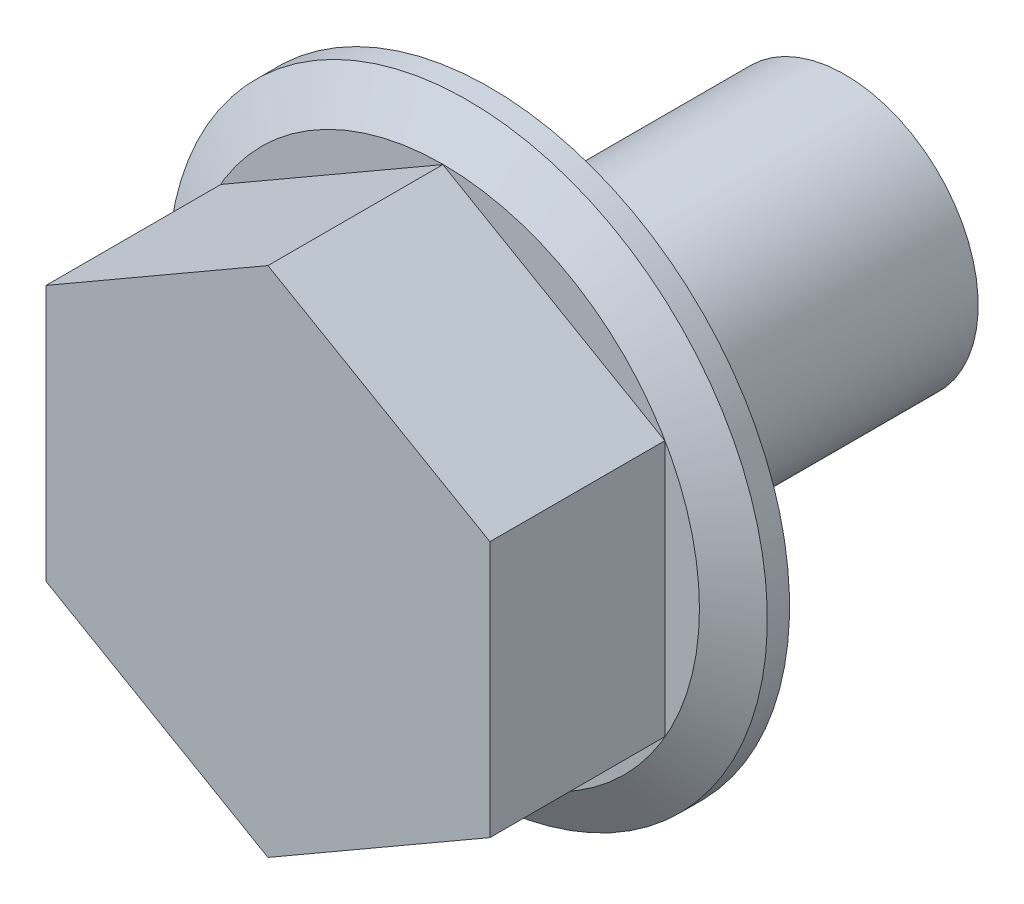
ISO-10303-21;
HEADER;
FILE_DESCRIPTION(('STEP AP214'),'2;1');
FILE_NAME('part.step','',(''),(''),'','','');
FILE_SCHEMA(('AUTOMOTIVE_DESIGN { 1 0 10303 214 1 1 1 1 }'));
ENDSEC;
DATA;
#1=APPLICATION_CONTEXT('core data for automotive mechanical design processes');
#2=APPLICATION_PROTOCOL_DEFINITION('international standard','automotive_design',2000,#1);
#3=PRODUCT_CONTEXT('',#1,'mechanical');
#4=PRODUCT('Part','Part','',(#3));
#5=PRODUCT_RELATED_PRODUCT_CATEGORY('part','',(#4));
#6=PRODUCT_DEFINITION_FORMATION('','',#4);
#7=PRODUCT_DEFINITION_CONTEXT('part definition',#1,'design');
#8=PRODUCT_DEFINITION('design','',#6,#7);
#9=PRODUCT_DEFINITION_SHAPE('','',#8);
#10=(LENGTH_UNIT() NAMED_UNIT(*) SI_UNIT(.MILLI.,.METRE.));
#11=(NAMED_UNIT(*) PLANE_ANGLE_UNIT() SI_UNIT($,.RADIAN.));
#12=(NAMED_UNIT(*) SI_UNIT($,.STERADIAN.) SOLID_ANGLE_UNIT());
#13=UNCERTAINTY_MEASURE_WITH_UNIT(LENGTH_MEASURE(1.E-05),#10,'distance_accuracy_value','');
#14=(GEOMETRIC_REPRESENTATION_CONTEXT(3) GLOBAL_UNCERTAINTY_ASSIGNED_CONTEXT((#13)) GLOBAL_UNIT_ASSIGNED_CONTEXT((#10,
#11,#12)) REPRESENTATION_CONTEXT('',''));
#15=CARTESIAN_POINT('',(0.,0.,0.));
#16=DIRECTION('',(0.,0.,1.));
#17=DIRECTION('',(1.,0.,0.));
#18=AXIS2_PLACEMENT_3D('',#15,#16,#17);
#19=CARTESIAN_POINT('',(0.,0.,0.5));
#20=DIRECTION('',(0.,0.,-1.));
#21=DIRECTION('',(-1.,0.,0.));
#22=AXIS2_PLACEMENT_3D('',#19,#20,#21);
#23=CONICAL_SURFACE('',#22,6.75,1.0471975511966);
#24=CARTESIAN_POINT('',(0.,0.,0.5));
#25=DIRECTION('',(0.,0.,-1.));
#26=DIRECTION('',(-1.,0.,0.));
#27=AXIS2_PLACEMENT_3D('',#24,#25,#26);
#28=CIRCLE('',#27,6.75);
#29=CARTESIAN_POINT('',(-6.75,0.,0.5));
#30=VERTEX_POINT('',#29);
#31=EDGE_CURVE('E123',#30,#30,#28,.T.);
#32=ORIENTED_EDGE('',*,*,#31,.F.);
#33=EDGE_LOOP('',(#32));
#34=FACE_BOUND('',#33,.T.);
#35=CARTESIAN_POINT('',(0.,0.,1.06));
#36=DIRECTION('',(0.,0.,1.));
#37=DIRECTION('',(1.,0.,0.));
#38=AXIS2_PLACEMENT_3D('',#35,#36,#37);
#39=CIRCLE('',#38,5.78005154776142);
#40=CARTESIAN_POINT('',(5.78005154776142,0.,1.06));
#41=VERTEX_POINT('',#40);
#42=EDGE_CURVE('E18',#41,#41,#39,.F.);
#43=ORIENTED_EDGE('',*,*,#42,.T.);
#44=EDGE_LOOP('',(#43));
#45=FACE_BOUND('',#44,.T.);
#46=ADVANCED_FACE('F14',(#34,#45),#23,.T.);
#47=CARTESIAN_POINT('',(0.,0.,-30.));
#48=DIRECTION('',(0.,0.,-1.));
#49=DIRECTION('',(-1.,0.,0.));
#50=AXIS2_PLACEMENT_3D('',#47,#48,#49);
#51=CYLINDRICAL_SURFACE('',#50,3.);
#52=CARTESIAN_POINT('',(0.,0.,0.));
#53=DIRECTION('',(0.,0.,-1.));
#54=DIRECTION('',(-1.,0.,0.));
#55=AXIS2_PLACEMENT_3D('',#52,#53,#54);
#56=CIRCLE('',#55,3.);
#57=CARTESIAN_POINT('',(-3.,0.,0.));
#58=VERTEX_POINT('',#57);
#59=EDGE_CURVE('E9',#58,#58,#56,.T.);
#60=ORIENTED_EDGE('',*,*,#59,.T.);
#61=EDGE_LOOP('',(#60));
#62=FACE_BOUND('',#61,.T.);
#63=CARTESIAN_POINT('',(0.,0.,-8.));
#64=DIRECTION('',(0.,0.,-1.));
#65=DIRECTION('',(-1.,0.,0.));
#66=AXIS2_PLACEMENT_3D('',#63,#64,#65);
#67=CIRCLE('',#66,3.);
#68=CARTESIAN_POINT('',(-3.,0.,-8.));
#69=VERTEX_POINT('',#68);
#70=EDGE_CURVE('E120',#69,#69,#67,.T.);
#71=ORIENTED_EDGE('',*,*,#70,.F.);
#72=EDGE_LOOP('',(#71));
#73=FACE_BOUND('',#72,.T.);
#74=ADVANCED_FACE('F16',(#62,#73),#51,.T.);
#75=CARTESIAN_POINT('',(0.,3.,0.));
#76=DIRECTION('',(0.,0.,-1.));
#77=DIRECTION('',(-1.,0.,0.));
#78=AXIS2_PLACEMENT_3D('',#75,#76,#77);
#79=PLANE('',#78);
#80=CARTESIAN_POINT('',(0.,0.,0.));
#81=DIRECTION('',(0.,0.,-1.));
#82=DIRECTION('',(-1.,0.,0.));
#83=AXIS2_PLACEMENT_3D('',#80,#81,#82);
#84=CIRCLE('',#83,6.75);
#85=CARTESIAN_POINT('',(-6.75,0.,0.));
#86=VERTEX_POINT('',#85);
#87=EDGE_CURVE('E23',#86,#86,#84,.T.);
#88=ORIENTED_EDGE('',*,*,#87,.T.);
#89=EDGE_LOOP('',(#88));
#90=FACE_BOUND('',#89,.T.);
#91=ORIENTED_EDGE('',*,*,#59,.F.);
#92=EDGE_LOOP('',(#91));
#93=FACE_BOUND('',#92,.T.);
#94=ADVANCED_FACE('F129',(#90,#93),#79,.T.);
#95=CARTESIAN_POINT('',(0.,0.,-30.));
#96=DIRECTION('',(0.,0.,-1.));
#97=DIRECTION('',(-1.,0.,0.));
#98=AXIS2_PLACEMENT_3D('',#95,#96,#97);
#99=CYLINDRICAL_SURFACE('',#98,6.75);
#100=ORIENTED_EDGE('',*,*,#31,.T.);
#101=EDGE_LOOP('',(#100));
#102=FACE_BOUND('',#101,.T.);
#103=ORIENTED_EDGE('',*,*,#87,.F.);
#104=EDGE_LOOP('',(#103));
#105=FACE_BOUND('',#104,.T.);
#106=ADVANCED_FACE('F132',(#102,#105),#99,.T.);
#107=CARTESIAN_POINT('',(0.,3.,-8.));
#108=DIRECTION('',(0.,0.,1.));
#109=DIRECTION('',(1.,0.,0.));
#110=AXIS2_PLACEMENT_3D('',#107,#108,#109);
#111=PLANE('',#110);
#112=ORIENTED_EDGE('',*,*,#70,.T.);
#113=EDGE_LOOP('',(#112));
#114=FACE_BOUND('',#113,.T.);
#115=ADVANCED_FACE('F134',(#114),#111,.F.);
#116=CARTESIAN_POINT('',(0.,0.,1.06));
#117=DIRECTION('',(0.,0.,1.));
#118=DIRECTION('',(1.,0.,0.));
#119=AXIS2_PLACEMENT_3D('',#116,#117,#118);
#120=PLANE('',#119);
#121=ORIENTED_EDGE('',*,*,#42,.F.);
#122=EDGE_LOOP('',(#121));
#123=FACE_BOUND('',#122,.T.);
#124=DIRECTION('',(0.,-1.,0.));
#125=VECTOR('',#124,1.);
#126=CARTESIAN_POINT('',(5.,2.88675134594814,1.06));
#127=LINE('',#126,#125);
#128=CARTESIAN_POINT('',(5.,2.88675134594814,1.06));
#129=VERTEX_POINT('',#128);
#130=CARTESIAN_POINT('',(5.,-2.88675134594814,1.06));
#131=VERTEX_POINT('',#130);
#132=EDGE_CURVE('E109',#129,#131,#127,.T.);
#133=ORIENTED_EDGE('',*,*,#132,.T.);
#134=DIRECTION('',(-0.866025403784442,-0.5,0.));
#135=VECTOR('',#134,1.);
#136=CARTESIAN_POINT('',(5.,-2.88675134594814,1.06));
#137=LINE('',#136,#135);
#138=CARTESIAN_POINT('',(0.,-5.77350269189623,1.06));
#139=VERTEX_POINT('',#138);
#140=EDGE_CURVE('E106',#131,#139,#137,.T.);
#141=ORIENTED_EDGE('',*,*,#140,.T.);
#142=DIRECTION('',(0.866025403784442,-0.5,0.));
#143=VECTOR('',#142,1.);
#144=CARTESIAN_POINT('',(-5.,-2.88675134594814,1.06));
#145=LINE('',#144,#143);
#146=CARTESIAN_POINT('',(-5.,-2.88675134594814,1.06));
#147=VERTEX_POINT('',#146);
#148=EDGE_CURVE('E104',#147,#139,#145,.T.);
#149=ORIENTED_EDGE('',*,*,#148,.F.);
#150=DIRECTION('',(0.,-1.,0.));
#151=VECTOR('',#150,1.);
#152=CARTESIAN_POINT('',(-5.,2.88675134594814,1.06));
#153=LINE('',#152,#151);
#154=CARTESIAN_POINT('',(-5.,2.88675134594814,1.06));
#155=VERTEX_POINT('',#154);
#156=EDGE_CURVE('E38',#155,#147,#153,.T.);
#157=ORIENTED_EDGE('',*,*,#156,.F.);
#158=DIRECTION('',(0.866025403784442,0.5,0.));
#159=VECTOR('',#158,1.);
#160=CARTESIAN_POINT('',(-5.,2.88675134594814,1.06));
#161=LINE('',#160,#159);
#162=CARTESIAN_POINT('',(0.,5.77350269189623,1.06));
#163=VERTEX_POINT('',#162);
#164=EDGE_CURVE('E101',#155,#163,#161,.T.);
#165=ORIENTED_EDGE('',*,*,#164,.T.);
#166=DIRECTION('',(-0.866025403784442,0.5,0.));
#167=VECTOR('',#166,1.);
#168=CARTESIAN_POINT('',(5.,2.88675134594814,1.06));
#169=LINE('',#168,#167);
#170=EDGE_CURVE('E98',#129,#163,#169,.T.);
#171=ORIENTED_EDGE('',*,*,#170,.F.);
#172=EDGE_LOOP('',(#133,#141,#149,#157,#165,#171));
#173=FACE_BOUND('',#172,.T.);
#174=ADVANCED_FACE('F143',(#123,#173),#120,.T.);
#175=CARTESIAN_POINT('',(5.,2.88675134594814,1.06));
#176=DIRECTION('',(0.5,0.866025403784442,0.));
#177=DIRECTION('',(-0.866025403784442,0.5,0.));
#178=AXIS2_PLACEMENT_3D('',#175,#176,#177);
#179=PLANE('',#178);
#180=DIRECTION('',(0.,0.,1.));
#181=VECTOR('',#180,1.);
#182=CARTESIAN_POINT('',(5.,2.88675134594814,1.06));
#183=LINE('',#182,#181);
#184=CARTESIAN_POINT('',(5.,2.88675134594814,5.));
#185=VERTEX_POINT('',#184);
#186=EDGE_CURVE('E118',#129,#185,#183,.T.);
#187=ORIENTED_EDGE('',*,*,#186,.F.);
#188=ORIENTED_EDGE('',*,*,#170,.T.);
#189=DIRECTION('',(0.,0.,1.));
#190=VECTOR('',#189,1.);
#191=CARTESIAN_POINT('',(0.,5.77350269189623,1.06));
#192=LINE('',#191,#190);
#193=CARTESIAN_POINT('',(0.,5.77350269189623,5.));
#194=VERTEX_POINT('',#193);
#195=EDGE_CURVE('E112',#163,#194,#192,.T.);
#196=ORIENTED_EDGE('',*,*,#195,.T.);
#197=DIRECTION('',(-0.866025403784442,0.5,0.));
#198=VECTOR('',#197,1.);
#199=CARTESIAN_POINT('',(5.,2.88675134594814,5.));
#200=LINE('',#199,#198);
#201=EDGE_CURVE('E90',#185,#194,#200,.T.);
#202=ORIENTED_EDGE('',*,*,#201,.F.);
#203=EDGE_LOOP('',(#187,#188,#196,#202));
#204=FACE_BOUND('',#203,.T.);
#205=ADVANCED_FACE('F162',(#204),#179,.T.);
#206=CARTESIAN_POINT('',(5.,2.88675134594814,1.06));
#207=DIRECTION('',(-1.,0.,0.));
#208=DIRECTION('',(0.,0.,1.));
#209=AXIS2_PLACEMENT_3D('',#206,#207,#208);
#210=PLANE('',#209);
#211=DIRECTION('',(0.,0.,1.));
#212=VECTOR('',#211,1.);
#213=CARTESIAN_POINT('',(5.,-2.88675134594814,1.06));
#214=LINE('',#213,#212);
#215=CARTESIAN_POINT('',(5.,-2.88675134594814,5.));
#216=VERTEX_POINT('',#215);
#217=EDGE_CURVE('E116',#131,#216,#214,.T.);
#218=ORIENTED_EDGE('',*,*,#217,.F.);
#219=ORIENTED_EDGE('',*,*,#132,.F.);
#220=ORIENTED_EDGE('',*,*,#186,.T.);
#221=DIRECTION('',(0.,-1.,0.));
#222=VECTOR('',#221,1.);
#223=CARTESIAN_POINT('',(5.,2.88675134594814,5.));
#224=LINE('',#223,#222);
#225=EDGE_CURVE('E95',#185,#216,#224,.T.);
#226=ORIENTED_EDGE('',*,*,#225,.T.);
#227=EDGE_LOOP('',(#218,#219,#220,#226));
#228=FACE_BOUND('',#227,.T.);
#229=ADVANCED_FACE('F164',(#228),#210,.F.);
#230=CARTESIAN_POINT('',(5.,-2.88675134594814,1.06));
#231=DIRECTION('',(-0.5,0.866025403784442,0.));
#232=DIRECTION('',(-0.866025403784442,-0.5,0.));
#233=AXIS2_PLACEMENT_3D('',#230,#231,#232);
#234=PLANE('',#233);
#235=DIRECTION('',(0.,0.,1.));
#236=VECTOR('',#235,1.);
#237=CARTESIAN_POINT('',(0.,-5.77350269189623,1.06));
#238=LINE('',#237,#236);
#239=CARTESIAN_POINT('',(0.,-5.77350269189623,5.));
#240=VERTEX_POINT('',#239);
#241=EDGE_CURVE('E72',#139,#240,#238,.T.);
#242=ORIENTED_EDGE('',*,*,#241,.F.);
#243=ORIENTED_EDGE('',*,*,#140,.F.);
#244=ORIENTED_EDGE('',*,*,#217,.T.);
#245=DIRECTION('',(-0.866025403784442,-0.5,0.));
#246=VECTOR('',#245,1.);
#247=CARTESIAN_POINT('',(5.,-2.88675134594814,5.));
#248=LINE('',#247,#246);
#249=EDGE_CURVE('E81',#216,#240,#248,.T.);
#250=ORIENTED_EDGE('',*,*,#249,.T.);
#251=EDGE_LOOP('',(#242,#243,#244,#250));
#252=FACE_BOUND('',#251,.T.);
#253=ADVANCED_FACE('F167',(#252),#234,.F.);
#254=CARTESIAN_POINT('',(-5.,-2.88675134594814,1.06));
#255=DIRECTION('',(-0.5,-0.866025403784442,0.));
#256=DIRECTION('',(0.866025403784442,-0.5,0.));
#257=AXIS2_PLACEMENT_3D('',#254,#255,#256);
#258=PLANE('',#257);
#259=DIRECTION('',(0.,0.,1.));
#260=VECTOR('',#259,1.);
#261=CARTESIAN_POINT('',(-5.,-2.88675134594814,1.06));
#262=LINE('',#261,#260);
#263=CARTESIAN_POINT('',(-5.,-2.88675134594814,5.));
#264=VERTEX_POINT('',#263);
#265=EDGE_CURVE('E67',#147,#264,#262,.T.);
#266=ORIENTED_EDGE('',*,*,#265,.F.);
#267=ORIENTED_EDGE('',*,*,#148,.T.);
#268=ORIENTED_EDGE('',*,*,#241,.T.);
#269=DIRECTION('',(0.866025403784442,-0.5,0.));
#270=VECTOR('',#269,1.);
#271=CARTESIAN_POINT('',(-5.,-2.88675134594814,5.));
#272=LINE('',#271,#270);
#273=EDGE_CURVE('E76',#264,#240,#272,.T.);
#274=ORIENTED_EDGE('',*,*,#273,.F.);
#275=EDGE_LOOP('',(#266,#267,#268,#274));
#276=FACE_BOUND('',#275,.T.);
#277=ADVANCED_FACE('F77',(#276),#258,.T.);
#278=CARTESIAN_POINT('',(-5.,2.88675134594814,1.06));
#279=DIRECTION('',(-1.,0.,0.));
#280=DIRECTION('',(0.,0.,1.));
#281=AXIS2_PLACEMENT_3D('',#278,#279,#280);
#282=PLANE('',#281);
#283=DIRECTION('',(0.,0.,1.));
#284=VECTOR('',#283,1.);
#285=CARTESIAN_POINT('',(-5.,2.88675134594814,1.06));
#286=LINE('',#285,#284);
#287=CARTESIAN_POINT('',(-5.,2.88675134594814,5.));
#288=VERTEX_POINT('',#287);
#289=EDGE_CURVE('E73',#155,#288,#286,.T.);
#290=ORIENTED_EDGE('',*,*,#289,.F.);
#291=ORIENTED_EDGE('',*,*,#156,.T.);
#292=ORIENTED_EDGE('',*,*,#265,.T.);
#293=DIRECTION('',(0.,-1.,0.));
#294=VECTOR('',#293,1.);
#295=CARTESIAN_POINT('',(-5.,2.88675134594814,5.));
#296=LINE('',#295,#294);
#297=EDGE_CURVE('E30',#288,#264,#296,.T.);
#298=ORIENTED_EDGE('',*,*,#297,.F.);
#299=EDGE_LOOP('',(#290,#291,#292,#298));
#300=FACE_BOUND('',#299,.T.);
#301=ADVANCED_FACE('F69',(#300),#282,.T.);
#302=CARTESIAN_POINT('',(-5.,2.88675134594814,1.06));
#303=DIRECTION('',(0.5,-0.866025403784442,0.));
#304=DIRECTION('',(0.866025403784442,0.5,0.));
#305=AXIS2_PLACEMENT_3D('',#302,#303,#304);
#306=PLANE('',#305);
#307=ORIENTED_EDGE('',*,*,#164,.F.);
#308=ORIENTED_EDGE('',*,*,#289,.T.);
#309=DIRECTION('',(0.866025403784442,0.5,0.));
#310=VECTOR('',#309,1.);
#311=CARTESIAN_POINT('',(-5.,2.88675134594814,5.));
#312=LINE('',#311,#310);
#313=EDGE_CURVE('E88',#288,#194,#312,.T.);
#314=ORIENTED_EDGE('',*,*,#313,.T.);
#315=ORIENTED_EDGE('',*,*,#195,.F.);
#316=EDGE_LOOP('',(#307,#308,#314,#315));
#317=FACE_BOUND('',#316,.T.);
#318=ADVANCED_FACE('F158',(#317),#306,.F.);
#319=CARTESIAN_POINT('',(0.,5.775,5.));
#320=DIRECTION('',(0.,0.,1.));
#321=DIRECTION('',(1.,0.,0.));
#322=AXIS2_PLACEMENT_3D('',#319,#320,#321);
#323=PLANE('',#322);
#324=ORIENTED_EDGE('',*,*,#225,.F.);
#325=ORIENTED_EDGE('',*,*,#201,.T.);
#326=ORIENTED_EDGE('',*,*,#313,.F.);
#327=ORIENTED_EDGE('',*,*,#297,.T.);
#328=ORIENTED_EDGE('',*,*,#273,.T.);
#329=ORIENTED_EDGE('',*,*,#249,.F.);
#330=EDGE_LOOP('',(#324,#325,#326,#327,#328,#329));
#331=FACE_BOUND('',#330,.T.);
#332=ADVANCED_FACE('F85',(#331),#323,.T.);
#333=CLOSED_SHELL('',(#46,#74,#94,#106,#115,#174,#205,#229,#253,#277,#301,#318,#332));
#334=MANIFOLD_SOLID_BREP('B1',#333);
#335=ADVANCED_BREP_SHAPE_REPRESENTATION('',(#18,#334),#14);
#336=SHAPE_DEFINITION_REPRESENTATION(#9,#335);
ENDSEC;
END-ISO-10303-21;
